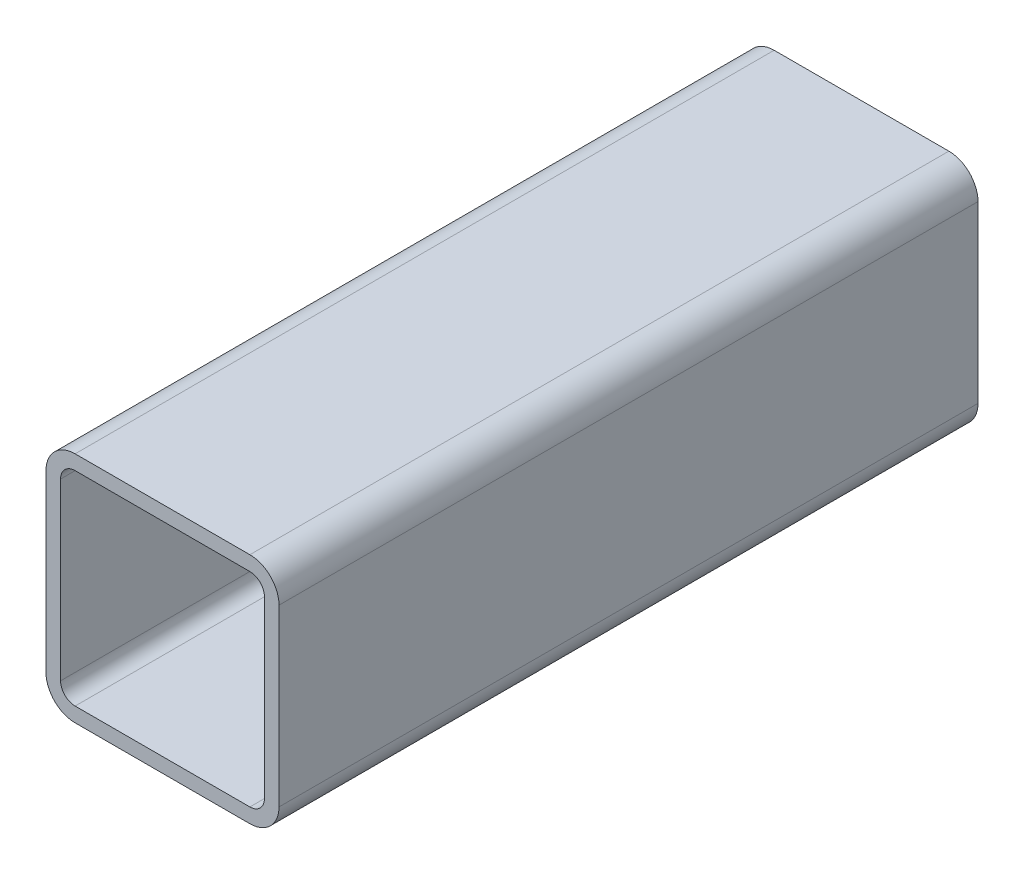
ISO-10303-21;
HEADER;
FILE_DESCRIPTION(('STEP AP214'),'2;1');
FILE_NAME('part.step','',(''),(''),'','','');
FILE_SCHEMA(('AUTOMOTIVE_DESIGN { 1 0 10303 214 1 1 1 1 }'));
ENDSEC;
DATA;
#1=APPLICATION_CONTEXT('core data for automotive mechanical design processes');
#2=APPLICATION_PROTOCOL_DEFINITION('international standard','automotive_design',2000,#1);
#3=PRODUCT_CONTEXT('',#1,'mechanical');
#4=PRODUCT('Part','Part','',(#3));
#5=PRODUCT_RELATED_PRODUCT_CATEGORY('part','',(#4));
#6=PRODUCT_DEFINITION_FORMATION('','',#4);
#7=PRODUCT_DEFINITION_CONTEXT('part definition',#1,'design');
#8=PRODUCT_DEFINITION('design','',#6,#7);
#9=PRODUCT_DEFINITION_SHAPE('','',#8);
#10=(LENGTH_UNIT() NAMED_UNIT(*) SI_UNIT(.MILLI.,.METRE.));
#11=(NAMED_UNIT(*) PLANE_ANGLE_UNIT() SI_UNIT($,.RADIAN.));
#12=(NAMED_UNIT(*) SI_UNIT($,.STERADIAN.) SOLID_ANGLE_UNIT());
#13=UNCERTAINTY_MEASURE_WITH_UNIT(LENGTH_MEASURE(1.E-05),#10,'distance_accuracy_value','');
#14=(GEOMETRIC_REPRESENTATION_CONTEXT(3) GLOBAL_UNCERTAINTY_ASSIGNED_CONTEXT((#13)) GLOBAL_UNIT_ASSIGNED_CONTEXT((#10,
#11,#12)) REPRESENTATION_CONTEXT('',''));
#15=CARTESIAN_POINT('',(0.,0.,0.));
#16=DIRECTION('',(0.,0.,1.));
#17=DIRECTION('',(1.,0.,0.));
#18=AXIS2_PLACEMENT_3D('',#15,#16,#17);
#19=CARTESIAN_POINT('',(14.3751778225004,90.9577651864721,304.8));
#20=DIRECTION('',(0.,0.,1.));
#21=DIRECTION('',(1.,0.,0.));
#22=AXIS2_PLACEMENT_3D('',#19,#20,#21);
#23=PLANE('',#22);
#24=CARTESIAN_POINT('',(14.3751778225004,90.9577651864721,304.8));
#25=DIRECTION('',(0.,0.,1.));
#26=DIRECTION('',(1.,0.,0.));
#27=AXIS2_PLACEMENT_3D('',#24,#25,#26);
#28=CIRCLE('',#27,12.7);
#29=CARTESIAN_POINT('',(14.3751778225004,103.657765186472,304.8));
#30=VERTEX_POINT('',#29);
#31=CARTESIAN_POINT('',(1.67517782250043,90.9577651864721,304.8));
#32=VERTEX_POINT('',#31);
#33=EDGE_CURVE('E211',#30,#32,#28,.T.);
#34=ORIENTED_EDGE('',*,*,#33,.T.);
#35=DIRECTION('',(0.,-1.,0.));
#36=VECTOR('',#35,1.);
#37=CARTESIAN_POINT('',(1.67517782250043,14.7577651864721,304.8));
#38=LINE('',#37,#36);
#39=CARTESIAN_POINT('',(1.67517782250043,14.7577651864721,304.8));
#40=VERTEX_POINT('',#39);
#41=EDGE_CURVE('E214',#32,#40,#38,.T.);
#42=ORIENTED_EDGE('',*,*,#41,.T.);
#43=CARTESIAN_POINT('',(14.3751778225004,14.7577651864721,304.8));
#44=DIRECTION('',(0.,0.,1.));
#45=DIRECTION('',(1.,0.,0.));
#46=AXIS2_PLACEMENT_3D('',#43,#44,#45);
#47=CIRCLE('',#46,12.7);
#48=CARTESIAN_POINT('',(14.3751778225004,2.05776518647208,304.8));
#49=VERTEX_POINT('',#48);
#50=EDGE_CURVE('E217',#40,#49,#47,.T.);
#51=ORIENTED_EDGE('',*,*,#50,.T.);
#52=DIRECTION('',(1.,0.,0.));
#53=VECTOR('',#52,1.);
#54=CARTESIAN_POINT('',(90.5751778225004,2.05776518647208,304.8));
#55=LINE('',#54,#53);
#56=CARTESIAN_POINT('',(90.5751778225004,2.05776518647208,304.8));
#57=VERTEX_POINT('',#56);
#58=EDGE_CURVE('E219',#49,#57,#55,.T.);
#59=ORIENTED_EDGE('',*,*,#58,.T.);
#60=CARTESIAN_POINT('',(90.5751778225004,14.7577651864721,304.8));
#61=DIRECTION('',(0.,0.,1.));
#62=DIRECTION('',(1.,0.,0.));
#63=AXIS2_PLACEMENT_3D('',#60,#61,#62);
#64=CIRCLE('',#63,12.7);
#65=CARTESIAN_POINT('',(103.2751778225,14.7577651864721,304.8));
#66=VERTEX_POINT('',#65);
#67=EDGE_CURVE('E221',#57,#66,#64,.T.);
#68=ORIENTED_EDGE('',*,*,#67,.T.);
#69=DIRECTION('',(0.,1.,0.));
#70=VECTOR('',#69,1.);
#71=CARTESIAN_POINT('',(103.2751778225,90.9577651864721,304.8));
#72=LINE('',#71,#70);
#73=CARTESIAN_POINT('',(103.2751778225,90.9577651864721,304.8));
#74=VERTEX_POINT('',#73);
#75=EDGE_CURVE('E223',#66,#74,#72,.T.);
#76=ORIENTED_EDGE('',*,*,#75,.T.);
#77=CARTESIAN_POINT('',(90.5751778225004,90.9577651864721,304.8));
#78=DIRECTION('',(0.,0.,1.));
#79=DIRECTION('',(1.,0.,0.));
#80=AXIS2_PLACEMENT_3D('',#77,#78,#79);
#81=CIRCLE('',#80,12.7);
#82=CARTESIAN_POINT('',(90.5751778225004,103.657765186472,304.8));
#83=VERTEX_POINT('',#82);
#84=EDGE_CURVE('E225',#74,#83,#81,.T.);
#85=ORIENTED_EDGE('',*,*,#84,.T.);
#86=DIRECTION('',(-1.,0.,0.));
#87=VECTOR('',#86,1.);
#88=CARTESIAN_POINT('',(14.3751778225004,103.657765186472,304.8));
#89=LINE('',#88,#87);
#90=EDGE_CURVE('E227',#83,#30,#89,.T.);
#91=ORIENTED_EDGE('',*,*,#90,.T.);
#92=EDGE_LOOP('',(#34,#42,#51,#59,#68,#76,#85,#91));
#93=FACE_BOUND('',#92,.T.);
#94=DIRECTION('',(0.,-1.,0.));
#95=VECTOR('',#94,1.);
#96=CARTESIAN_POINT('',(8.02517782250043,14.7577651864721,304.8));
#97=LINE('',#96,#95);
#98=CARTESIAN_POINT('',(8.02517782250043,90.9577651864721,304.8));
#99=VERTEX_POINT('',#98);
#100=CARTESIAN_POINT('',(8.02517782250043,14.7577651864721,304.8));
#101=VERTEX_POINT('',#100);
#102=EDGE_CURVE('E154',#99,#101,#97,.T.);
#103=ORIENTED_EDGE('',*,*,#102,.F.);
#104=CARTESIAN_POINT('',(14.3751778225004,90.9577651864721,304.8));
#105=DIRECTION('',(0.,0.,1.));
#106=DIRECTION('',(1.,0.,0.));
#107=AXIS2_PLACEMENT_3D('',#104,#105,#106);
#108=CIRCLE('',#107,6.35000000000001);
#109=CARTESIAN_POINT('',(14.3751778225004,97.3077651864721,304.8));
#110=VERTEX_POINT('',#109);
#111=EDGE_CURVE('E146',#110,#99,#108,.T.);
#112=ORIENTED_EDGE('',*,*,#111,.F.);
#113=DIRECTION('',(-1.,0.,0.));
#114=VECTOR('',#113,1.);
#115=CARTESIAN_POINT('',(14.3751778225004,97.3077651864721,304.8));
#116=LINE('',#115,#114);
#117=CARTESIAN_POINT('',(90.5751778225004,97.3077651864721,304.8));
#118=VERTEX_POINT('',#117);
#119=EDGE_CURVE('E179',#118,#110,#116,.T.);
#120=ORIENTED_EDGE('',*,*,#119,.F.);
#121=CARTESIAN_POINT('',(90.5751778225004,90.9577651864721,304.8));
#122=DIRECTION('',(0.,0.,1.));
#123=DIRECTION('',(1.,0.,0.));
#124=AXIS2_PLACEMENT_3D('',#121,#122,#123);
#125=CIRCLE('',#124,6.35000000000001);
#126=CARTESIAN_POINT('',(96.9251778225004,90.9577651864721,304.8));
#127=VERTEX_POINT('',#126);
#128=EDGE_CURVE('E177',#127,#118,#125,.T.);
#129=ORIENTED_EDGE('',*,*,#128,.F.);
#130=DIRECTION('',(0.,1.,0.));
#131=VECTOR('',#130,1.);
#132=CARTESIAN_POINT('',(96.9251778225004,90.9577651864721,304.8));
#133=LINE('',#132,#131);
#134=CARTESIAN_POINT('',(96.9251778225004,14.7577651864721,304.8));
#135=VERTEX_POINT('',#134);
#136=EDGE_CURVE('E175',#135,#127,#133,.T.);
#137=ORIENTED_EDGE('',*,*,#136,.F.);
#138=CARTESIAN_POINT('',(90.5751778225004,14.7577651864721,304.8));
#139=DIRECTION('',(0.,0.,1.));
#140=DIRECTION('',(1.,0.,0.));
#141=AXIS2_PLACEMENT_3D('',#138,#139,#140);
#142=CIRCLE('',#141,6.35000000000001);
#143=CARTESIAN_POINT('',(90.5751778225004,8.40776518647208,304.8));
#144=VERTEX_POINT('',#143);
#145=EDGE_CURVE('E173',#144,#135,#142,.T.);
#146=ORIENTED_EDGE('',*,*,#145,.F.);
#147=DIRECTION('',(1.,0.,0.));
#148=VECTOR('',#147,1.);
#149=CARTESIAN_POINT('',(90.5751778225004,8.40776518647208,304.8));
#150=LINE('',#149,#148);
#151=CARTESIAN_POINT('',(14.3751778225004,8.40776518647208,304.8));
#152=VERTEX_POINT('',#151);
#153=EDGE_CURVE('E169',#152,#144,#150,.T.);
#154=ORIENTED_EDGE('',*,*,#153,.F.);
#155=CARTESIAN_POINT('',(14.3751778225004,14.7577651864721,304.8));
#156=DIRECTION('',(0.,0.,1.));
#157=DIRECTION('',(1.,0.,0.));
#158=AXIS2_PLACEMENT_3D('',#155,#156,#157);
#159=CIRCLE('',#158,6.35);
#160=EDGE_CURVE('E167',#101,#152,#159,.T.);
#161=ORIENTED_EDGE('',*,*,#160,.F.);
#162=EDGE_LOOP('',(#103,#112,#120,#129,#137,#146,#154,#161));
#163=FACE_BOUND('',#162,.T.);
#164=ADVANCED_FACE('F33',(#93,#163),#23,.T.);
#165=CARTESIAN_POINT('',(14.3751778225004,90.9577651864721,0.));
#166=DIRECTION('',(0.,0.,1.));
#167=DIRECTION('',(1.,0.,0.));
#168=AXIS2_PLACEMENT_3D('',#165,#166,#167);
#169=PLANE('',#168);
#170=CARTESIAN_POINT('',(14.3751778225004,90.9577651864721,0.));
#171=DIRECTION('',(0.,0.,1.));
#172=DIRECTION('',(1.,0.,0.));
#173=AXIS2_PLACEMENT_3D('',#170,#171,#172);
#174=CIRCLE('',#173,12.7);
#175=CARTESIAN_POINT('',(14.3751778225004,103.657765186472,0.));
#176=VERTEX_POINT('',#175);
#177=CARTESIAN_POINT('',(1.67517782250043,90.9577651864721,0.));
#178=VERTEX_POINT('',#177);
#179=EDGE_CURVE('E162',#176,#178,#174,.T.);
#180=ORIENTED_EDGE('',*,*,#179,.F.);
#181=DIRECTION('',(-1.,0.,0.));
#182=VECTOR('',#181,1.);
#183=CARTESIAN_POINT('',(14.3751778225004,103.657765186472,0.));
#184=LINE('',#183,#182);
#185=CARTESIAN_POINT('',(90.5751778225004,103.657765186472,0.));
#186=VERTEX_POINT('',#185);
#187=EDGE_CURVE('E215',#186,#176,#184,.T.);
#188=ORIENTED_EDGE('',*,*,#187,.F.);
#189=CARTESIAN_POINT('',(90.5751778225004,90.9577651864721,0.));
#190=DIRECTION('',(0.,0.,1.));
#191=DIRECTION('',(1.,0.,0.));
#192=AXIS2_PLACEMENT_3D('',#189,#190,#191);
#193=CIRCLE('',#192,12.7);
#194=CARTESIAN_POINT('',(103.2751778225,90.9577651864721,0.));
#195=VERTEX_POINT('',#194);
#196=EDGE_CURVE('E242',#195,#186,#193,.T.);
#197=ORIENTED_EDGE('',*,*,#196,.F.);
#198=DIRECTION('',(0.,1.,0.));
#199=VECTOR('',#198,1.);
#200=CARTESIAN_POINT('',(103.2751778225,90.9577651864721,0.));
#201=LINE('',#200,#199);
#202=CARTESIAN_POINT('',(103.2751778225,14.7577651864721,0.));
#203=VERTEX_POINT('',#202);
#204=EDGE_CURVE('E240',#203,#195,#201,.T.);
#205=ORIENTED_EDGE('',*,*,#204,.F.);
#206=CARTESIAN_POINT('',(90.5751778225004,14.7577651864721,0.));
#207=DIRECTION('',(0.,0.,1.));
#208=DIRECTION('',(1.,0.,0.));
#209=AXIS2_PLACEMENT_3D('',#206,#207,#208);
#210=CIRCLE('',#209,12.7);
#211=CARTESIAN_POINT('',(90.5751778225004,2.05776518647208,0.));
#212=VERTEX_POINT('',#211);
#213=EDGE_CURVE('E238',#212,#203,#210,.T.);
#214=ORIENTED_EDGE('',*,*,#213,.F.);
#215=DIRECTION('',(1.,0.,0.));
#216=VECTOR('',#215,1.);
#217=CARTESIAN_POINT('',(90.5751778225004,2.05776518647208,0.));
#218=LINE('',#217,#216);
#219=CARTESIAN_POINT('',(14.3751778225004,2.05776518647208,0.));
#220=VERTEX_POINT('',#219);
#221=EDGE_CURVE('E236',#220,#212,#218,.T.);
#222=ORIENTED_EDGE('',*,*,#221,.F.);
#223=CARTESIAN_POINT('',(14.3751778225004,14.7577651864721,0.));
#224=DIRECTION('',(0.,0.,1.));
#225=DIRECTION('',(1.,0.,0.));
#226=AXIS2_PLACEMENT_3D('',#223,#224,#225);
#227=CIRCLE('',#226,12.7);
#228=CARTESIAN_POINT('',(1.67517782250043,14.7577651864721,0.));
#229=VERTEX_POINT('',#228);
#230=EDGE_CURVE('E234',#229,#220,#227,.T.);
#231=ORIENTED_EDGE('',*,*,#230,.F.);
#232=DIRECTION('',(0.,-1.,0.));
#233=VECTOR('',#232,1.);
#234=CARTESIAN_POINT('',(1.67517782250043,14.7577651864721,0.));
#235=LINE('',#234,#233);
#236=EDGE_CURVE('E232',#178,#229,#235,.T.);
#237=ORIENTED_EDGE('',*,*,#236,.F.);
#238=EDGE_LOOP('',(#180,#188,#197,#205,#214,#222,#231,#237));
#239=FACE_BOUND('',#238,.T.);
#240=CARTESIAN_POINT('',(14.3751778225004,90.9577651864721,0.));
#241=DIRECTION('',(0.,0.,1.));
#242=DIRECTION('',(1.,0.,0.));
#243=AXIS2_PLACEMENT_3D('',#240,#241,#242);
#244=CIRCLE('',#243,6.35000000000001);
#245=CARTESIAN_POINT('',(14.3751778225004,97.3077651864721,0.));
#246=VERTEX_POINT('',#245);
#247=CARTESIAN_POINT('',(8.02517782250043,90.9577651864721,0.));
#248=VERTEX_POINT('',#247);
#249=EDGE_CURVE('E56',#246,#248,#244,.T.);
#250=ORIENTED_EDGE('',*,*,#249,.T.);
#251=DIRECTION('',(0.,-1.,0.));
#252=VECTOR('',#251,1.);
#253=CARTESIAN_POINT('',(8.02517782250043,14.7577651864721,0.));
#254=LINE('',#253,#252);
#255=CARTESIAN_POINT('',(8.02517782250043,14.7577651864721,0.));
#256=VERTEX_POINT('',#255);
#257=EDGE_CURVE('E161',#248,#256,#254,.T.);
#258=ORIENTED_EDGE('',*,*,#257,.T.);
#259=CARTESIAN_POINT('',(14.3751778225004,14.7577651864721,0.));
#260=DIRECTION('',(0.,0.,1.));
#261=DIRECTION('',(1.,0.,0.));
#262=AXIS2_PLACEMENT_3D('',#259,#260,#261);
#263=CIRCLE('',#262,6.35);
#264=CARTESIAN_POINT('',(14.3751778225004,8.40776518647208,0.));
#265=VERTEX_POINT('',#264);
#266=EDGE_CURVE('E183',#256,#265,#263,.T.);
#267=ORIENTED_EDGE('',*,*,#266,.T.);
#268=DIRECTION('',(1.,0.,0.));
#269=VECTOR('',#268,1.);
#270=CARTESIAN_POINT('',(90.5751778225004,8.40776518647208,0.));
#271=LINE('',#270,#269);
#272=CARTESIAN_POINT('',(90.5751778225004,8.40776518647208,0.));
#273=VERTEX_POINT('',#272);
#274=EDGE_CURVE('E186',#265,#273,#271,.T.);
#275=ORIENTED_EDGE('',*,*,#274,.T.);
#276=CARTESIAN_POINT('',(90.5751778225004,14.7577651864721,0.));
#277=DIRECTION('',(0.,0.,1.));
#278=DIRECTION('',(1.,0.,0.));
#279=AXIS2_PLACEMENT_3D('',#276,#277,#278);
#280=CIRCLE('',#279,6.35000000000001);
#281=CARTESIAN_POINT('',(96.9251778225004,14.7577651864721,0.));
#282=VERTEX_POINT('',#281);
#283=EDGE_CURVE('E189',#273,#282,#280,.T.);
#284=ORIENTED_EDGE('',*,*,#283,.T.);
#285=DIRECTION('',(0.,1.,0.));
#286=VECTOR('',#285,1.);
#287=CARTESIAN_POINT('',(96.9251778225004,90.9577651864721,0.));
#288=LINE('',#287,#286);
#289=CARTESIAN_POINT('',(96.9251778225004,90.9577651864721,0.));
#290=VERTEX_POINT('',#289);
#291=EDGE_CURVE('E192',#282,#290,#288,.T.);
#292=ORIENTED_EDGE('',*,*,#291,.T.);
#293=CARTESIAN_POINT('',(90.5751778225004,90.9577651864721,0.));
#294=DIRECTION('',(0.,0.,1.));
#295=DIRECTION('',(1.,0.,0.));
#296=AXIS2_PLACEMENT_3D('',#293,#294,#295);
#297=CIRCLE('',#296,6.35000000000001);
#298=CARTESIAN_POINT('',(90.5751778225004,97.3077651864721,0.));
#299=VERTEX_POINT('',#298);
#300=EDGE_CURVE('E195',#290,#299,#297,.T.);
#301=ORIENTED_EDGE('',*,*,#300,.T.);
#302=DIRECTION('',(-1.,0.,0.));
#303=VECTOR('',#302,1.);
#304=CARTESIAN_POINT('',(14.3751778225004,97.3077651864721,0.));
#305=LINE('',#304,#303);
#306=EDGE_CURVE('E155',#299,#246,#305,.T.);
#307=ORIENTED_EDGE('',*,*,#306,.T.);
#308=EDGE_LOOP('',(#250,#258,#267,#275,#284,#292,#301,#307));
#309=FACE_BOUND('',#308,.T.);
#310=ADVANCED_FACE('F272',(#239,#309),#169,.F.);
#311=CARTESIAN_POINT('',(14.3751778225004,90.9577651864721,304.8));
#312=DIRECTION('',(0.,0.,-1.));
#313=DIRECTION('',(-1.,0.,0.));
#314=AXIS2_PLACEMENT_3D('',#311,#312,#313);
#315=CYLINDRICAL_SURFACE('',#314,12.7);
#316=ORIENTED_EDGE('',*,*,#179,.T.);
#317=DIRECTION('',(0.,0.,-1.));
#318=VECTOR('',#317,1.);
#319=CARTESIAN_POINT('',(1.67517782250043,90.9577651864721,304.8));
#320=LINE('',#319,#318);
#321=EDGE_CURVE('E11',#32,#178,#320,.T.);
#322=ORIENTED_EDGE('',*,*,#321,.F.);
#323=ORIENTED_EDGE('',*,*,#33,.F.);
#324=DIRECTION('',(0.,0.,-1.));
#325=VECTOR('',#324,1.);
#326=CARTESIAN_POINT('',(14.3751778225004,103.657765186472,304.8));
#327=LINE('',#326,#325);
#328=EDGE_CURVE('E229',#30,#176,#327,.T.);
#329=ORIENTED_EDGE('',*,*,#328,.T.);
#330=EDGE_LOOP('',(#316,#322,#323,#329));
#331=FACE_BOUND('',#330,.T.);
#332=ADVANCED_FACE('F35',(#331),#315,.T.);
#333=CARTESIAN_POINT('',(1.67517782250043,14.7577651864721,304.8));
#334=DIRECTION('',(1.,0.,0.));
#335=DIRECTION('',(0.,0.,-1.));
#336=AXIS2_PLACEMENT_3D('',#333,#334,#335);
#337=PLANE('',#336);
#338=ORIENTED_EDGE('',*,*,#236,.T.);
#339=DIRECTION('',(0.,0.,-1.));
#340=VECTOR('',#339,1.);
#341=CARTESIAN_POINT('',(1.67517782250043,14.7577651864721,304.8));
#342=LINE('',#341,#340);
#343=EDGE_CURVE('E41',#40,#229,#342,.T.);
#344=ORIENTED_EDGE('',*,*,#343,.F.);
#345=ORIENTED_EDGE('',*,*,#41,.F.);
#346=ORIENTED_EDGE('',*,*,#321,.T.);
#347=EDGE_LOOP('',(#338,#344,#345,#346));
#348=FACE_BOUND('',#347,.T.);
#349=ADVANCED_FACE('F289',(#348),#337,.F.);
#350=CARTESIAN_POINT('',(14.3751778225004,14.7577651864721,304.8));
#351=DIRECTION('',(0.,0.,-1.));
#352=DIRECTION('',(-1.,0.,0.));
#353=AXIS2_PLACEMENT_3D('',#350,#351,#352);
#354=CYLINDRICAL_SURFACE('',#353,12.7);
#355=ORIENTED_EDGE('',*,*,#230,.T.);
#356=DIRECTION('',(0.,0.,-1.));
#357=VECTOR('',#356,1.);
#358=CARTESIAN_POINT('',(14.3751778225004,2.05776518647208,304.8));
#359=LINE('',#358,#357);
#360=EDGE_CURVE('E259',#49,#220,#359,.T.);
#361=ORIENTED_EDGE('',*,*,#360,.F.);
#362=ORIENTED_EDGE('',*,*,#50,.F.);
#363=ORIENTED_EDGE('',*,*,#343,.T.);
#364=EDGE_LOOP('',(#355,#361,#362,#363));
#365=FACE_BOUND('',#364,.T.);
#366=ADVANCED_FACE('F266',(#365),#354,.T.);
#367=CARTESIAN_POINT('',(90.5751778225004,2.05776518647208,304.8));
#368=DIRECTION('',(0.,1.,0.));
#369=DIRECTION('',(0.,0.,1.));
#370=AXIS2_PLACEMENT_3D('',#367,#368,#369);
#371=PLANE('',#370);
#372=ORIENTED_EDGE('',*,*,#221,.T.);
#373=DIRECTION('',(0.,0.,-1.));
#374=VECTOR('',#373,1.);
#375=CARTESIAN_POINT('',(90.5751778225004,2.05776518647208,304.8));
#376=LINE('',#375,#374);
#377=EDGE_CURVE('E256',#57,#212,#376,.T.);
#378=ORIENTED_EDGE('',*,*,#377,.F.);
#379=ORIENTED_EDGE('',*,*,#58,.F.);
#380=ORIENTED_EDGE('',*,*,#360,.T.);
#381=EDGE_LOOP('',(#372,#378,#379,#380));
#382=FACE_BOUND('',#381,.T.);
#383=ADVANCED_FACE('F278',(#382),#371,.F.);
#384=CARTESIAN_POINT('',(90.5751778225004,14.7577651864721,304.8));
#385=DIRECTION('',(0.,0.,-1.));
#386=DIRECTION('',(-1.,0.,0.));
#387=AXIS2_PLACEMENT_3D('',#384,#385,#386);
#388=CYLINDRICAL_SURFACE('',#387,12.7);
#389=ORIENTED_EDGE('',*,*,#213,.T.);
#390=DIRECTION('',(0.,0.,-1.));
#391=VECTOR('',#390,1.);
#392=CARTESIAN_POINT('',(103.2751778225,14.7577651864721,304.8));
#393=LINE('',#392,#391);
#394=EDGE_CURVE('E253',#66,#203,#393,.T.);
#395=ORIENTED_EDGE('',*,*,#394,.F.);
#396=ORIENTED_EDGE('',*,*,#67,.F.);
#397=ORIENTED_EDGE('',*,*,#377,.T.);
#398=EDGE_LOOP('',(#389,#395,#396,#397));
#399=FACE_BOUND('',#398,.T.);
#400=ADVANCED_FACE('F282',(#399),#388,.T.);
#401=CARTESIAN_POINT('',(103.2751778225,90.9577651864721,304.8));
#402=DIRECTION('',(-1.,0.,0.));
#403=DIRECTION('',(0.,0.,1.));
#404=AXIS2_PLACEMENT_3D('',#401,#402,#403);
#405=PLANE('',#404);
#406=ORIENTED_EDGE('',*,*,#204,.T.);
#407=DIRECTION('',(0.,0.,-1.));
#408=VECTOR('',#407,1.);
#409=CARTESIAN_POINT('',(103.2751778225,90.9577651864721,304.8));
#410=LINE('',#409,#408);
#411=EDGE_CURVE('E250',#74,#195,#410,.T.);
#412=ORIENTED_EDGE('',*,*,#411,.F.);
#413=ORIENTED_EDGE('',*,*,#75,.F.);
#414=ORIENTED_EDGE('',*,*,#394,.T.);
#415=EDGE_LOOP('',(#406,#412,#413,#414));
#416=FACE_BOUND('',#415,.T.);
#417=ADVANCED_FACE('F302',(#416),#405,.F.);
#418=CARTESIAN_POINT('',(90.5751778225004,90.9577651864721,304.8));
#419=DIRECTION('',(0.,0.,-1.));
#420=DIRECTION('',(-1.,0.,0.));
#421=AXIS2_PLACEMENT_3D('',#418,#419,#420);
#422=CYLINDRICAL_SURFACE('',#421,12.7);
#423=ORIENTED_EDGE('',*,*,#196,.T.);
#424=DIRECTION('',(0.,0.,-1.));
#425=VECTOR('',#424,1.);
#426=CARTESIAN_POINT('',(90.5751778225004,103.657765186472,304.8));
#427=LINE('',#426,#425);
#428=EDGE_CURVE('E247',#83,#186,#427,.T.);
#429=ORIENTED_EDGE('',*,*,#428,.F.);
#430=ORIENTED_EDGE('',*,*,#84,.F.);
#431=ORIENTED_EDGE('',*,*,#411,.T.);
#432=EDGE_LOOP('',(#423,#429,#430,#431));
#433=FACE_BOUND('',#432,.T.);
#434=ADVANCED_FACE('F300',(#433),#422,.T.);
#435=CARTESIAN_POINT('',(14.3751778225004,103.657765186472,304.8));
#436=DIRECTION('',(0.,-1.,0.));
#437=DIRECTION('',(0.,0.,-1.));
#438=AXIS2_PLACEMENT_3D('',#435,#436,#437);
#439=PLANE('',#438);
#440=ORIENTED_EDGE('',*,*,#187,.T.);
#441=ORIENTED_EDGE('',*,*,#328,.F.);
#442=ORIENTED_EDGE('',*,*,#90,.F.);
#443=ORIENTED_EDGE('',*,*,#428,.T.);
#444=EDGE_LOOP('',(#440,#441,#442,#443));
#445=FACE_BOUND('',#444,.T.);
#446=ADVANCED_FACE('F295',(#445),#439,.F.);
#447=CARTESIAN_POINT('',(14.3751778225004,90.9577651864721,304.8));
#448=DIRECTION('',(0.,0.,-1.));
#449=DIRECTION('',(-1.,0.,0.));
#450=AXIS2_PLACEMENT_3D('',#447,#448,#449);
#451=CYLINDRICAL_SURFACE('',#450,6.35000000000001);
#452=ORIENTED_EDGE('',*,*,#249,.F.);
#453=DIRECTION('',(0.,0.,-1.));
#454=VECTOR('',#453,1.);
#455=CARTESIAN_POINT('',(14.3751778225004,97.3077651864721,304.8));
#456=LINE('',#455,#454);
#457=EDGE_CURVE('E150',#110,#246,#456,.T.);
#458=ORIENTED_EDGE('',*,*,#457,.F.);
#459=ORIENTED_EDGE('',*,*,#111,.T.);
#460=DIRECTION('',(0.,0.,-1.));
#461=VECTOR('',#460,1.);
#462=CARTESIAN_POINT('',(8.02517782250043,90.9577651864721,304.8));
#463=LINE('',#462,#461);
#464=EDGE_CURVE('E149',#99,#248,#463,.T.);
#465=ORIENTED_EDGE('',*,*,#464,.T.);
#466=EDGE_LOOP('',(#452,#458,#459,#465));
#467=FACE_BOUND('',#466,.T.);
#468=ADVANCED_FACE('F148',(#467),#451,.F.);
#469=CARTESIAN_POINT('',(8.02517782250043,14.7577651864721,304.8));
#470=DIRECTION('',(1.,0.,0.));
#471=DIRECTION('',(0.,0.,-1.));
#472=AXIS2_PLACEMENT_3D('',#469,#470,#471);
#473=PLANE('',#472);
#474=ORIENTED_EDGE('',*,*,#257,.F.);
#475=ORIENTED_EDGE('',*,*,#464,.F.);
#476=ORIENTED_EDGE('',*,*,#102,.T.);
#477=DIRECTION('',(0.,0.,-1.));
#478=VECTOR('',#477,1.);
#479=CARTESIAN_POINT('',(8.02517782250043,14.7577651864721,304.8));
#480=LINE('',#479,#478);
#481=EDGE_CURVE('E163',#101,#256,#480,.T.);
#482=ORIENTED_EDGE('',*,*,#481,.T.);
#483=EDGE_LOOP('',(#474,#475,#476,#482));
#484=FACE_BOUND('',#483,.T.);
#485=ADVANCED_FACE('F158',(#484),#473,.T.);
#486=CARTESIAN_POINT('',(14.3751778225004,14.7577651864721,304.8));
#487=DIRECTION('',(0.,0.,-1.));
#488=DIRECTION('',(-1.,0.,0.));
#489=AXIS2_PLACEMENT_3D('',#486,#487,#488);
#490=CYLINDRICAL_SURFACE('',#489,6.35);
#491=ORIENTED_EDGE('',*,*,#266,.F.);
#492=ORIENTED_EDGE('',*,*,#481,.F.);
#493=ORIENTED_EDGE('',*,*,#160,.T.);
#494=DIRECTION('',(0.,0.,-1.));
#495=VECTOR('',#494,1.);
#496=CARTESIAN_POINT('',(14.3751778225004,8.40776518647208,304.8));
#497=LINE('',#496,#495);
#498=EDGE_CURVE('E208',#152,#265,#497,.T.);
#499=ORIENTED_EDGE('',*,*,#498,.T.);
#500=EDGE_LOOP('',(#491,#492,#493,#499));
#501=FACE_BOUND('',#500,.T.);
#502=ADVANCED_FACE('F327',(#501),#490,.F.);
#503=CARTESIAN_POINT('',(90.5751778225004,8.40776518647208,304.8));
#504=DIRECTION('',(0.,1.,0.));
#505=DIRECTION('',(0.,0.,1.));
#506=AXIS2_PLACEMENT_3D('',#503,#504,#505);
#507=PLANE('',#506);
#508=ORIENTED_EDGE('',*,*,#274,.F.);
#509=ORIENTED_EDGE('',*,*,#498,.F.);
#510=ORIENTED_EDGE('',*,*,#153,.T.);
#511=DIRECTION('',(0.,0.,-1.));
#512=VECTOR('',#511,1.);
#513=CARTESIAN_POINT('',(90.5751778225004,8.40776518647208,304.8));
#514=LINE('',#513,#512);
#515=EDGE_CURVE('E206',#144,#273,#514,.T.);
#516=ORIENTED_EDGE('',*,*,#515,.T.);
#517=EDGE_LOOP('',(#508,#509,#510,#516));
#518=FACE_BOUND('',#517,.T.);
#519=ADVANCED_FACE('F331',(#518),#507,.T.);
#520=CARTESIAN_POINT('',(90.5751778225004,14.7577651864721,304.8));
#521=DIRECTION('',(0.,0.,-1.));
#522=DIRECTION('',(-1.,0.,0.));
#523=AXIS2_PLACEMENT_3D('',#520,#521,#522);
#524=CYLINDRICAL_SURFACE('',#523,6.35000000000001);
#525=ORIENTED_EDGE('',*,*,#283,.F.);
#526=ORIENTED_EDGE('',*,*,#515,.F.);
#527=ORIENTED_EDGE('',*,*,#145,.T.);
#528=DIRECTION('',(0.,0.,-1.));
#529=VECTOR('',#528,1.);
#530=CARTESIAN_POINT('',(96.9251778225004,14.7577651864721,304.8));
#531=LINE('',#530,#529);
#532=EDGE_CURVE('E204',#135,#282,#531,.T.);
#533=ORIENTED_EDGE('',*,*,#532,.T.);
#534=EDGE_LOOP('',(#525,#526,#527,#533));
#535=FACE_BOUND('',#534,.T.);
#536=ADVANCED_FACE('F337',(#535),#524,.F.);
#537=CARTESIAN_POINT('',(96.9251778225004,90.9577651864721,304.8));
#538=DIRECTION('',(-1.,0.,0.));
#539=DIRECTION('',(0.,0.,1.));
#540=AXIS2_PLACEMENT_3D('',#537,#538,#539);
#541=PLANE('',#540);
#542=ORIENTED_EDGE('',*,*,#291,.F.);
#543=ORIENTED_EDGE('',*,*,#532,.F.);
#544=ORIENTED_EDGE('',*,*,#136,.T.);
#545=DIRECTION('',(0.,0.,-1.));
#546=VECTOR('',#545,1.);
#547=CARTESIAN_POINT('',(96.9251778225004,90.9577651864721,304.8));
#548=LINE('',#547,#546);
#549=EDGE_CURVE('E202',#127,#290,#548,.T.);
#550=ORIENTED_EDGE('',*,*,#549,.T.);
#551=EDGE_LOOP('',(#542,#543,#544,#550));
#552=FACE_BOUND('',#551,.T.);
#553=ADVANCED_FACE('F341',(#552),#541,.T.);
#554=CARTESIAN_POINT('',(90.5751778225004,90.9577651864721,304.8));
#555=DIRECTION('',(0.,0.,-1.));
#556=DIRECTION('',(-1.,0.,0.));
#557=AXIS2_PLACEMENT_3D('',#554,#555,#556);
#558=CYLINDRICAL_SURFACE('',#557,6.35000000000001);
#559=ORIENTED_EDGE('',*,*,#300,.F.);
#560=ORIENTED_EDGE('',*,*,#549,.F.);
#561=ORIENTED_EDGE('',*,*,#128,.T.);
#562=DIRECTION('',(0.,0.,-1.));
#563=VECTOR('',#562,1.);
#564=CARTESIAN_POINT('',(90.5751778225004,97.3077651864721,304.8));
#565=LINE('',#564,#563);
#566=EDGE_CURVE('E48',#118,#299,#565,.T.);
#567=ORIENTED_EDGE('',*,*,#566,.T.);
#568=EDGE_LOOP('',(#559,#560,#561,#567));
#569=FACE_BOUND('',#568,.T.);
#570=ADVANCED_FACE('F345',(#569),#558,.F.);
#571=CARTESIAN_POINT('',(14.3751778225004,97.3077651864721,304.8));
#572=DIRECTION('',(0.,-1.,0.));
#573=DIRECTION('',(0.,0.,-1.));
#574=AXIS2_PLACEMENT_3D('',#571,#572,#573);
#575=PLANE('',#574);
#576=ORIENTED_EDGE('',*,*,#306,.F.);
#577=ORIENTED_EDGE('',*,*,#566,.F.);
#578=ORIENTED_EDGE('',*,*,#119,.T.);
#579=ORIENTED_EDGE('',*,*,#457,.T.);
#580=EDGE_LOOP('',(#576,#577,#578,#579));
#581=FACE_BOUND('',#580,.T.);
#582=ADVANCED_FACE('F349',(#581),#575,.T.);
#583=CLOSED_SHELL('',(#164,#310,#332,#349,#366,#383,#400,#417,#434,#446,#468,#485,#502,#519,
#536,#553,#570,#582));
#584=MANIFOLD_SOLID_BREP('B2',#583);
#585=ADVANCED_BREP_SHAPE_REPRESENTATION('',(#18,#584),#14);
#586=SHAPE_DEFINITION_REPRESENTATION(#9,#585);
ENDSEC;
END-ISO-10303-21;
